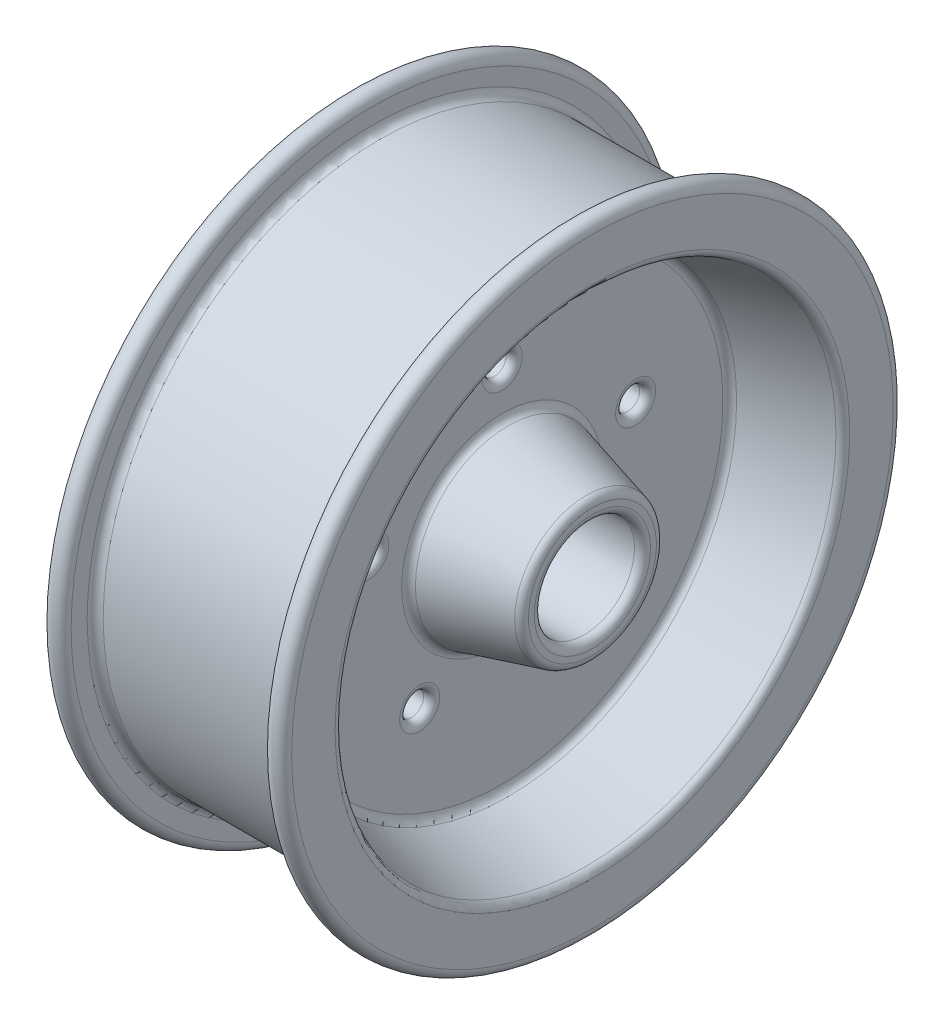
from build123d import *

# Parameters (mm, degrees)
SKETCH2_R          = 3.81
CUT_EXTRUDE1_DEPTH = 148.115947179
FILLET1_R          = 2.54


with BuildPart() as part:
    # Sketch1 → Revolve1 (revolve)
    with BuildSketch(Plane.XY, mode=Mode.PRIVATE) as revolve1_sk:
        with BuildLine():
            Line((-38.1, 15.875), (38.1, 15.875))
            Line((38.1, 15.875), (38.1, 22.225))
            Line((38.1, 22.225), (9.525, 29.881648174))
            Line((9.525, 29.881648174), (9.525, 71.870751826))
            Line((9.525, 71.870751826), (38.1, 79.5274))
            Line((38.1, 79.5274), (38.1, 95.25))
            ThreePointArc((38.1, 95.25), (34.925, 98.425), (31.75, 95.25))
            Line((31.75, 95.25), (31.75, 87.63))
            Line((31.75, 87.63), (-31.75, 87.63))
            Line((-31.75, 87.63), (-31.75, 95.25))
            ThreePointArc((-31.75, 95.25), (-34.925, 98.425), (-38.1, 95.25))
            Line((-38.1, 95.25), (-38.1, 79.5274))
            Line((-38.1, 79.5274), (-9.525, 71.870751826))
            Line((-9.525, 71.870751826), (-9.525, 29.881648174))
            Line((-9.525, 29.881648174), (-38.1, 22.225))
            Line((-38.1, 22.225), (-38.1, 15.875))
        make_face()
    revolve(revolve1_sk.sketch.rotate(Axis((0, 0, 0), (1, 0, 0)), 90), axis=Axis((0, 0, 0), (1, 0, 0)))

    # Sketch2 → Cut-Extrude1 (cut, through all)
    with BuildSketch(Plane(origin=(9.525, 0, 0), x_dir=(0, 0, -1), z_dir=(1, 0, 0))):
        with Locations((0, 44.45)):
            Circle(SKETCH2_R)
        with Locations((42.274462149, 13.7358054)):
            Circle(SKETCH2_R)
        with Locations((26.127054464, -35.9608054)):
            Circle(SKETCH2_R)
        with Locations((-26.127054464, -35.9608054)):
            Circle(SKETCH2_R)
        with Locations((-42.274462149, 13.7358054)):
            Circle(SKETCH2_R)
    extrude(amount=-CUT_EXTRUDE1_DEPTH, mode=Mode.SUBTRACT)

    # Fillet1
    fillet1_edges = [part.edges().sort_by_distance(p)[0] for p in [
        (-9.525, 0, -29.881648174),
        (-9.525, 0, -71.870751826),
        (-38.1, 0, -79.5274),
        (-31.75, 0, -87.63),
        (31.75, 0, -87.63),
        (38.1, 0, -79.5274),
        (9.525, 0, -71.870751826),
        (9.525, 0, -29.881648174),
        (38.1, 0, -22.225),
        (38.1, 0, -15.875),
        (-38.1, 0, -15.875),
        (-38.1, 0, -22.225),
        (-9.525, 44.45, 3.81),
        (9.525, 44.45, 3.81),
        (-9.525, 13.7358054, -38.464462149),
        (9.525, 13.7358054, -38.464462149),
        (-9.525, -35.9608054, -22.317054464),
        (9.525, -35.9608054, -22.317054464),
        (-9.525, -35.9608054, 29.937054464),
        (9.525, -35.9608054, 29.937054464),
        (-9.525, 13.7358054, 46.084462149),
        (9.525, 13.7358054, 46.084462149),
    ]]
    fillet(fillet1_edges, radius=FILLET1_R)


solid = part.part
